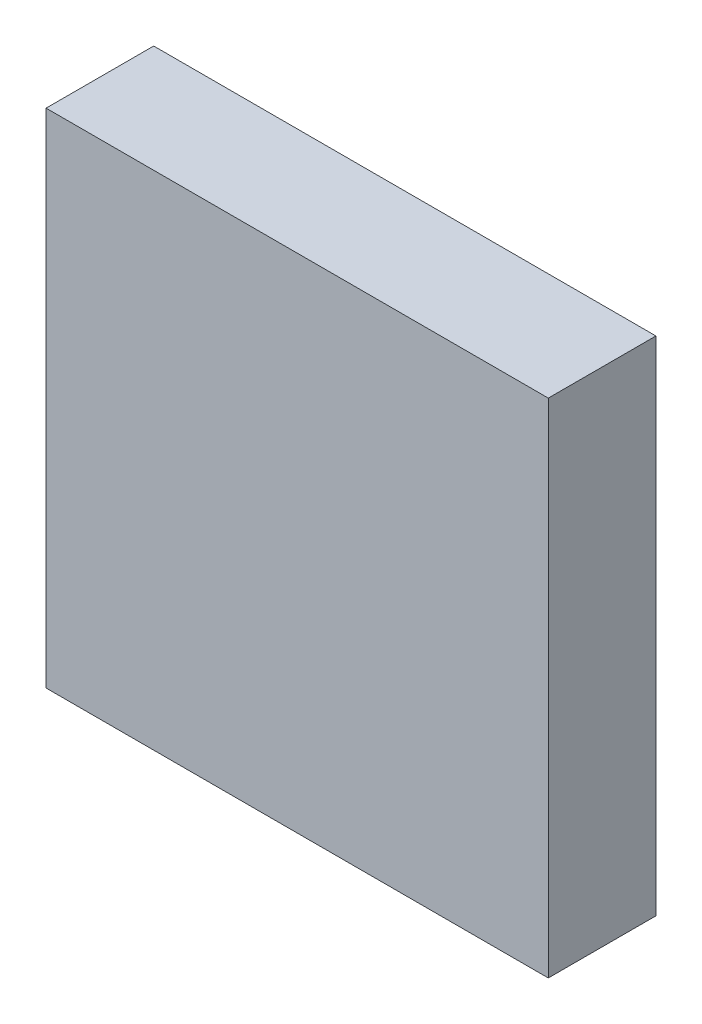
from build123d import *

# Parameters (mm, degrees)
SKETCH1_W      = 14
SKETCH1_H      = 14
EXTRUDE1_DEPTH = 3


with BuildPart() as part:
    # Sketch1 → Extrude1 (new body)
    with BuildSketch(Plane.XY):
        Rectangle(SKETCH1_W, SKETCH1_H)
    extrude(amount=EXTRUDE1_DEPTH)


solid = part.part
